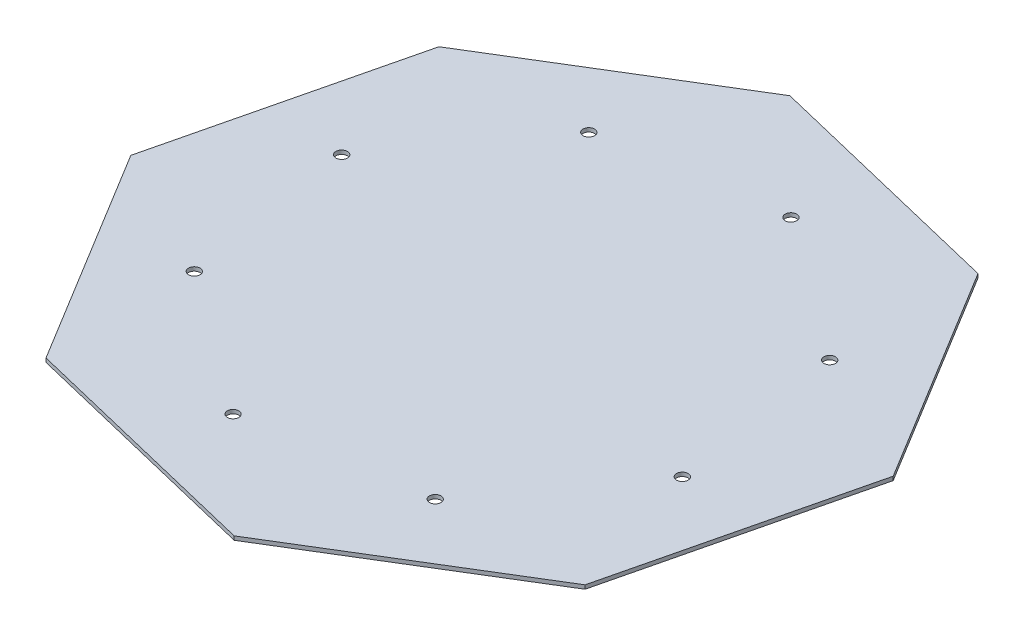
from build123d import *

# Parameters (mm, degrees)
SKETCH2_R           = 1.5
BOSS_EXTRUDE2_DEPTH = 1


with BuildPart() as part:
    # Sketch2 → Boss-Extrude2 (new body)
    with BuildSketch(Plane(origin=(0, 0, 0), x_dir=(1, 0, 0), z_dir=(0, 1, 0))):
        Polygon((-13.413820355, 85.546103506), (-69.975233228, 51.005226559), (-85.546103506, -13.413820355), (-51.005226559, -69.975233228), (13.413820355, -85.546103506), (69.975233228, -51.005226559), (85.546103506, 13.413820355), (51.005226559, 69.975233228), align=None)
        with Locations(Location((-14.096777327, -58.320501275, 0), (0, 0, 270))):
            Circle(SKETCH2_R, mode=Mode.SUBTRACT)
        with Locations(Location((14.096777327, 58.320501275, 0), (0, 0, 270))):
            Circle(SKETCH2_R, mode=Mode.SUBTRACT)
        with Locations(Location((-58.320501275, 14.096777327, 0), (0, 0, 270))):
            Circle(SKETCH2_R, mode=Mode.SUBTRACT)
        with Locations(Location((58.320501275, -14.096777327, 0), (0, 0, 270))):
            Circle(SKETCH2_R, mode=Mode.SUBTRACT)
        with Locations(Location((-31.270895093, 51.206748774, 0), (0, 0, 270))):
            Circle(SKETCH2_R, mode=Mode.SUBTRACT)
        with Locations(Location((51.206748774, 31.270895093, 0), (0, 0, 270))):
            Circle(SKETCH2_R, mode=Mode.SUBTRACT)
        with Locations(Location((31.270895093, -51.206748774, 0), (0, 0, 270))):
            Circle(SKETCH2_R, mode=Mode.SUBTRACT)
        with Locations(Location((-51.206748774, -31.270895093, 0), (0, 0, 270))):
            Circle(SKETCH2_R, mode=Mode.SUBTRACT)
    extrude(amount=BOSS_EXTRUDE2_DEPTH)


solid = part.part
